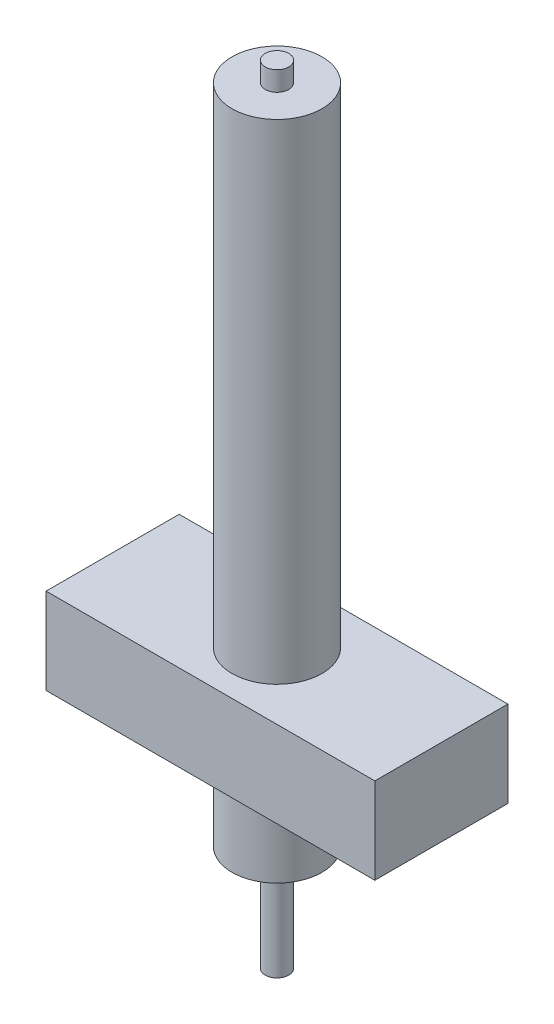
ISO-10303-21;
HEADER;
FILE_DESCRIPTION(('STEP AP214'),'2;1');
FILE_NAME('part.step','',(''),(''),'','','');
FILE_SCHEMA(('AUTOMOTIVE_DESIGN { 1 0 10303 214 1 1 1 1 }'));
ENDSEC;
DATA;
#1=APPLICATION_CONTEXT('core data for automotive mechanical design processes');
#2=APPLICATION_PROTOCOL_DEFINITION('international standard','automotive_design',2000,#1);
#3=PRODUCT_CONTEXT('',#1,'mechanical');
#4=PRODUCT('Part','Part','',(#3));
#5=PRODUCT_RELATED_PRODUCT_CATEGORY('part','',(#4));
#6=PRODUCT_DEFINITION_FORMATION('','',#4);
#7=PRODUCT_DEFINITION_CONTEXT('part definition',#1,'design');
#8=PRODUCT_DEFINITION('design','',#6,#7);
#9=PRODUCT_DEFINITION_SHAPE('','',#8);
#10=(LENGTH_UNIT() NAMED_UNIT(*) SI_UNIT(.MILLI.,.METRE.));
#11=(NAMED_UNIT(*) PLANE_ANGLE_UNIT() SI_UNIT($,.RADIAN.));
#12=(NAMED_UNIT(*) SI_UNIT($,.STERADIAN.) SOLID_ANGLE_UNIT());
#13=UNCERTAINTY_MEASURE_WITH_UNIT(LENGTH_MEASURE(1.E-05),#10,'distance_accuracy_value','');
#14=(GEOMETRIC_REPRESENTATION_CONTEXT(3) GLOBAL_UNCERTAINTY_ASSIGNED_CONTEXT((#13)) GLOBAL_UNIT_ASSIGNED_CONTEXT((#10,
#11,#12)) REPRESENTATION_CONTEXT('',''));
#15=CARTESIAN_POINT('',(0.,0.,0.));
#16=DIRECTION('',(0.,0.,1.));
#17=DIRECTION('',(1.,0.,0.));
#18=AXIS2_PLACEMENT_3D('',#15,#16,#17);
#19=CARTESIAN_POINT('',(0.,62.5,0.));
#20=DIRECTION('',(0.,-1.,0.));
#21=DIRECTION('',(0.,0.,-1.));
#22=AXIS2_PLACEMENT_3D('',#19,#20,#21);
#23=CYLINDRICAL_SURFACE('',#22,5.75);
#24=CARTESIAN_POINT('',(0.,62.5,0.));
#25=DIRECTION('',(0.,1.,0.));
#26=DIRECTION('',(0.,0.,1.));
#27=AXIS2_PLACEMENT_3D('',#24,#25,#26);
#28=CIRCLE('',#27,5.75);
#29=CARTESIAN_POINT('',(0.,62.5,5.75));
#30=VERTEX_POINT('',#29);
#31=EDGE_CURVE('E121',#30,#30,#28,.T.);
#32=ORIENTED_EDGE('',*,*,#31,.F.);
#33=EDGE_LOOP('',(#32));
#34=FACE_BOUND('',#33,.T.);
#35=CARTESIAN_POINT('',(0.,0.,0.));
#36=DIRECTION('',(0.,1.,0.));
#37=DIRECTION('',(0.,0.,1.));
#38=AXIS2_PLACEMENT_3D('',#35,#36,#37);
#39=CIRCLE('',#38,5.75);
#40=CARTESIAN_POINT('',(0.,0.,5.75));
#41=VERTEX_POINT('',#40);
#42=EDGE_CURVE('E42',#41,#41,#39,.T.);
#43=ORIENTED_EDGE('',*,*,#42,.T.);
#44=EDGE_LOOP('',(#43));
#45=FACE_BOUND('',#44,.T.);
#46=ADVANCED_FACE('F39',(#34,#45),#23,.T.);
#47=CARTESIAN_POINT('',(0.,62.5,0.));
#48=DIRECTION('',(0.,1.,0.));
#49=DIRECTION('',(0.,0.,1.));
#50=AXIS2_PLACEMENT_3D('',#47,#48,#49);
#51=PLANE('',#50);
#52=CARTESIAN_POINT('',(0.,62.5,0.));
#53=DIRECTION('',(0.,1.,0.));
#54=DIRECTION('',(0.,0.,1.));
#55=AXIS2_PLACEMENT_3D('',#52,#53,#54);
#56=CIRCLE('',#55,1.5);
#57=CARTESIAN_POINT('',(0.,62.5,1.5));
#58=VERTEX_POINT('',#57);
#59=EDGE_CURVE('E122',#58,#58,#56,.T.);
#60=ORIENTED_EDGE('',*,*,#59,.F.);
#61=EDGE_LOOP('',(#60));
#62=FACE_BOUND('',#61,.T.);
#63=ORIENTED_EDGE('',*,*,#31,.T.);
#64=EDGE_LOOP('',(#63));
#65=FACE_BOUND('',#64,.T.);
#66=ADVANCED_FACE('F127',(#62,#65),#51,.T.);
#67=CARTESIAN_POINT('',(0.,65.,0.));
#68=DIRECTION('',(0.,-1.,0.));
#69=DIRECTION('',(0.,0.,-1.));
#70=AXIS2_PLACEMENT_3D('',#67,#68,#69);
#71=CYLINDRICAL_SURFACE('',#70,1.5);
#72=CARTESIAN_POINT('',(0.,65.,0.));
#73=DIRECTION('',(0.,1.,0.));
#74=DIRECTION('',(0.,0.,1.));
#75=AXIS2_PLACEMENT_3D('',#72,#73,#74);
#76=CIRCLE('',#75,1.5);
#77=CARTESIAN_POINT('',(0.,65.,1.5));
#78=VERTEX_POINT('',#77);
#79=EDGE_CURVE('E118',#78,#78,#76,.T.);
#80=ORIENTED_EDGE('',*,*,#79,.F.);
#81=EDGE_LOOP('',(#80));
#82=FACE_BOUND('',#81,.T.);
#83=ORIENTED_EDGE('',*,*,#59,.T.);
#84=EDGE_LOOP('',(#83));
#85=FACE_BOUND('',#84,.T.);
#86=ADVANCED_FACE('F160',(#82,#85),#71,.T.);
#87=CARTESIAN_POINT('',(0.,65.,0.));
#88=DIRECTION('',(0.,1.,0.));
#89=DIRECTION('',(0.,0.,1.));
#90=AXIS2_PLACEMENT_3D('',#87,#88,#89);
#91=PLANE('',#90);
#92=ORIENTED_EDGE('',*,*,#79,.T.);
#93=EDGE_LOOP('',(#92));
#94=FACE_BOUND('',#93,.T.);
#95=ADVANCED_FACE('F157',(#94),#91,.T.);
#96=CARTESIAN_POINT('',(21.,-11.,-8.5));
#97=DIRECTION('',(-1.,0.,0.));
#98=DIRECTION('',(0.,0.,1.));
#99=AXIS2_PLACEMENT_3D('',#96,#97,#98);
#100=PLANE('',#99);
#101=DIRECTION('',(0.,0.,1.));
#102=VECTOR('',#101,1.);
#103=CARTESIAN_POINT('',(21.,0.,-8.5));
#104=LINE('',#103,#102);
#105=CARTESIAN_POINT('',(21.,0.,-8.5));
#106=VERTEX_POINT('',#105);
#107=CARTESIAN_POINT('',(21.,0.,8.5));
#108=VERTEX_POINT('',#107);
#109=EDGE_CURVE('E108',#106,#108,#104,.T.);
#110=ORIENTED_EDGE('',*,*,#109,.T.);
#111=DIRECTION('',(0.,1.,0.));
#112=VECTOR('',#111,1.);
#113=CARTESIAN_POINT('',(21.,-11.,8.5));
#114=LINE('',#113,#112);
#115=CARTESIAN_POINT('',(21.,-11.,8.5));
#116=VERTEX_POINT('',#115);
#117=EDGE_CURVE('E99',#116,#108,#114,.T.);
#118=ORIENTED_EDGE('',*,*,#117,.F.);
#119=DIRECTION('',(0.,0.,1.));
#120=VECTOR('',#119,1.);
#121=CARTESIAN_POINT('',(21.,-11.,-8.5));
#122=LINE('',#121,#120);
#123=CARTESIAN_POINT('',(21.,-11.,-8.5));
#124=VERTEX_POINT('',#123);
#125=EDGE_CURVE('E93',#124,#116,#122,.T.);
#126=ORIENTED_EDGE('',*,*,#125,.F.);
#127=DIRECTION('',(0.,1.,0.));
#128=VECTOR('',#127,1.);
#129=CARTESIAN_POINT('',(21.,-11.,-8.5));
#130=LINE('',#129,#128);
#131=EDGE_CURVE('E104',#124,#106,#130,.T.);
#132=ORIENTED_EDGE('',*,*,#131,.T.);
#133=EDGE_LOOP('',(#110,#118,#126,#132));
#134=FACE_BOUND('',#133,.T.);
#135=ADVANCED_FACE('F141',(#134),#100,.F.);
#136=CARTESIAN_POINT('',(-21.,-11.,8.5));
#137=DIRECTION('',(0.,0.,-1.));
#138=DIRECTION('',(-1.,0.,0.));
#139=AXIS2_PLACEMENT_3D('',#136,#137,#138);
#140=PLANE('',#139);
#141=DIRECTION('',(-1.,0.,0.));
#142=VECTOR('',#141,1.);
#143=CARTESIAN_POINT('',(-21.,0.,8.5));
#144=LINE('',#143,#142);
#145=CARTESIAN_POINT('',(-21.,0.,8.5));
#146=VERTEX_POINT('',#145);
#147=EDGE_CURVE('E98',#108,#146,#144,.T.);
#148=ORIENTED_EDGE('',*,*,#147,.T.);
#149=DIRECTION('',(0.,1.,0.));
#150=VECTOR('',#149,1.);
#151=CARTESIAN_POINT('',(-21.,-11.,8.5));
#152=LINE('',#151,#150);
#153=CARTESIAN_POINT('',(-21.,-11.,8.5));
#154=VERTEX_POINT('',#153);
#155=EDGE_CURVE('E96',#154,#146,#152,.T.);
#156=ORIENTED_EDGE('',*,*,#155,.F.);
#157=DIRECTION('',(-1.,0.,0.));
#158=VECTOR('',#157,1.);
#159=CARTESIAN_POINT('',(-21.,-11.,8.5));
#160=LINE('',#159,#158);
#161=EDGE_CURVE('E88',#116,#154,#160,.T.);
#162=ORIENTED_EDGE('',*,*,#161,.F.);
#163=ORIENTED_EDGE('',*,*,#117,.T.);
#164=EDGE_LOOP('',(#148,#156,#162,#163));
#165=FACE_BOUND('',#164,.T.);
#166=ADVANCED_FACE('F97',(#165),#140,.F.);
#167=CARTESIAN_POINT('',(-21.,-11.,-8.5));
#168=DIRECTION('',(1.,0.,0.));
#169=DIRECTION('',(0.,0.,-1.));
#170=AXIS2_PLACEMENT_3D('',#167,#168,#169);
#171=PLANE('',#170);
#172=DIRECTION('',(0.,0.,-1.));
#173=VECTOR('',#172,1.);
#174=CARTESIAN_POINT('',(-21.,0.,-8.5));
#175=LINE('',#174,#173);
#176=CARTESIAN_POINT('',(-21.,0.,-8.5));
#177=VERTEX_POINT('',#176);
#178=EDGE_CURVE('E74',#146,#177,#175,.T.);
#179=ORIENTED_EDGE('',*,*,#178,.T.);
#180=DIRECTION('',(0.,1.,0.));
#181=VECTOR('',#180,1.);
#182=CARTESIAN_POINT('',(-21.,-11.,-8.5));
#183=LINE('',#182,#181);
#184=CARTESIAN_POINT('',(-21.,-11.,-8.5));
#185=VERTEX_POINT('',#184);
#186=EDGE_CURVE('E100',#185,#177,#183,.T.);
#187=ORIENTED_EDGE('',*,*,#186,.F.);
#188=DIRECTION('',(0.,0.,-1.));
#189=VECTOR('',#188,1.);
#190=CARTESIAN_POINT('',(-21.,-11.,-8.5));
#191=LINE('',#190,#189);
#192=EDGE_CURVE('E91',#154,#185,#191,.T.);
#193=ORIENTED_EDGE('',*,*,#192,.F.);
#194=ORIENTED_EDGE('',*,*,#155,.T.);
#195=EDGE_LOOP('',(#179,#187,#193,#194));
#196=FACE_BOUND('',#195,.T.);
#197=ADVANCED_FACE('F102',(#196),#171,.F.);
#198=CARTESIAN_POINT('',(-21.,-11.,-8.5));
#199=DIRECTION('',(0.,0.,1.));
#200=DIRECTION('',(1.,0.,0.));
#201=AXIS2_PLACEMENT_3D('',#198,#199,#200);
#202=PLANE('',#201);
#203=DIRECTION('',(1.,0.,0.));
#204=VECTOR('',#203,1.);
#205=CARTESIAN_POINT('',(-21.,0.,-8.5));
#206=LINE('',#205,#204);
#207=EDGE_CURVE('E80',#177,#106,#206,.T.);
#208=ORIENTED_EDGE('',*,*,#207,.T.);
#209=ORIENTED_EDGE('',*,*,#131,.F.);
#210=DIRECTION('',(1.,0.,0.));
#211=VECTOR('',#210,1.);
#212=CARTESIAN_POINT('',(-21.,-11.,-8.5));
#213=LINE('',#212,#211);
#214=EDGE_CURVE('E57',#185,#124,#213,.T.);
#215=ORIENTED_EDGE('',*,*,#214,.F.);
#216=ORIENTED_EDGE('',*,*,#186,.T.);
#217=EDGE_LOOP('',(#208,#209,#215,#216));
#218=FACE_BOUND('',#217,.T.);
#219=ADVANCED_FACE('F142',(#218),#202,.F.);
#220=CARTESIAN_POINT('',(0.,-11.,0.));
#221=DIRECTION('',(0.,1.,0.));
#222=DIRECTION('',(0.,0.,1.));
#223=AXIS2_PLACEMENT_3D('',#220,#221,#222);
#224=PLANE('',#223);
#225=CARTESIAN_POINT('',(0.,-11.,0.));
#226=DIRECTION('',(0.,-1.,0.));
#227=DIRECTION('',(0.,0.,-1.));
#228=AXIS2_PLACEMENT_3D('',#225,#226,#227);
#229=CIRCLE('',#228,5.75);
#230=CARTESIAN_POINT('',(0.,-11.,-5.75));
#231=VERTEX_POINT('',#230);
#232=EDGE_CURVE('E48',#231,#231,#229,.T.);
#233=ORIENTED_EDGE('',*,*,#232,.F.);
#234=EDGE_LOOP('',(#233));
#235=FACE_BOUND('',#234,.T.);
#236=ORIENTED_EDGE('',*,*,#125,.T.);
#237=ORIENTED_EDGE('',*,*,#161,.T.);
#238=ORIENTED_EDGE('',*,*,#192,.T.);
#239=ORIENTED_EDGE('',*,*,#214,.T.);
#240=EDGE_LOOP('',(#236,#237,#238,#239));
#241=FACE_BOUND('',#240,.T.);
#242=ADVANCED_FACE('F89',(#235,#241),#224,.F.);
#243=CARTESIAN_POINT('',(0.,0.,0.));
#244=DIRECTION('',(0.,1.,0.));
#245=DIRECTION('',(0.,0.,1.));
#246=AXIS2_PLACEMENT_3D('',#243,#244,#245);
#247=PLANE('',#246);
#248=ORIENTED_EDGE('',*,*,#42,.F.);
#249=EDGE_LOOP('',(#248));
#250=FACE_BOUND('',#249,.T.);
#251=ORIENTED_EDGE('',*,*,#109,.F.);
#252=ORIENTED_EDGE('',*,*,#207,.F.);
#253=ORIENTED_EDGE('',*,*,#178,.F.);
#254=ORIENTED_EDGE('',*,*,#147,.F.);
#255=EDGE_LOOP('',(#251,#252,#253,#254));
#256=FACE_BOUND('',#255,.T.);
#257=ADVANCED_FACE('F134',(#250,#256),#247,.T.);
#258=CARTESIAN_POINT('',(0.,-22.,0.));
#259=DIRECTION('',(0.,1.,0.));
#260=DIRECTION('',(0.,0.,1.));
#261=AXIS2_PLACEMENT_3D('',#258,#259,#260);
#262=CYLINDRICAL_SURFACE('',#261,5.75);
#263=CARTESIAN_POINT('',(0.,-22.,0.));
#264=DIRECTION('',(0.,-1.,0.));
#265=DIRECTION('',(0.,0.,-1.));
#266=AXIS2_PLACEMENT_3D('',#263,#264,#265);
#267=CIRCLE('',#266,5.75);
#268=CARTESIAN_POINT('',(0.,-22.,-5.75));
#269=VERTEX_POINT('',#268);
#270=EDGE_CURVE('E111',#269,#269,#267,.T.);
#271=ORIENTED_EDGE('',*,*,#270,.F.);
#272=EDGE_LOOP('',(#271));
#273=FACE_BOUND('',#272,.T.);
#274=ORIENTED_EDGE('',*,*,#232,.T.);
#275=EDGE_LOOP('',(#274));
#276=FACE_BOUND('',#275,.T.);
#277=ADVANCED_FACE('F137',(#273,#276),#262,.T.);
#278=CARTESIAN_POINT('',(0.,-22.,0.));
#279=DIRECTION('',(0.,-1.,0.));
#280=DIRECTION('',(0.,0.,-1.));
#281=AXIS2_PLACEMENT_3D('',#278,#279,#280);
#282=PLANE('',#281);
#283=CARTESIAN_POINT('',(0.,-22.,0.));
#284=DIRECTION('',(0.,-1.,0.));
#285=DIRECTION('',(0.,0.,-1.));
#286=AXIS2_PLACEMENT_3D('',#283,#284,#285);
#287=CIRCLE('',#286,1.5);
#288=CARTESIAN_POINT('',(0.,-22.,-1.5));
#289=VERTEX_POINT('',#288);
#290=EDGE_CURVE('E11',#289,#289,#287,.T.);
#291=ORIENTED_EDGE('',*,*,#290,.F.);
#292=EDGE_LOOP('',(#291));
#293=FACE_BOUND('',#292,.T.);
#294=ORIENTED_EDGE('',*,*,#270,.T.);
#295=EDGE_LOOP('',(#294));
#296=FACE_BOUND('',#295,.T.);
#297=ADVANCED_FACE('F223',(#293,#296),#282,.T.);
#298=CARTESIAN_POINT('',(0.,-35.5,0.));
#299=DIRECTION('',(0.,1.,0.));
#300=DIRECTION('',(0.,0.,1.));
#301=AXIS2_PLACEMENT_3D('',#298,#299,#300);
#302=CYLINDRICAL_SURFACE('',#301,1.5);
#303=CARTESIAN_POINT('',(0.,-35.5,0.));
#304=DIRECTION('',(0.,-1.,0.));
#305=DIRECTION('',(0.,0.,-1.));
#306=AXIS2_PLACEMENT_3D('',#303,#304,#305);
#307=CIRCLE('',#306,1.5);
#308=CARTESIAN_POINT('',(0.,-35.5,-1.5));
#309=VERTEX_POINT('',#308);
#310=EDGE_CURVE('E258',#309,#309,#307,.T.);
#311=ORIENTED_EDGE('',*,*,#310,.F.);
#312=EDGE_LOOP('',(#311));
#313=FACE_BOUND('',#312,.T.);
#314=ORIENTED_EDGE('',*,*,#290,.T.);
#315=EDGE_LOOP('',(#314));
#316=FACE_BOUND('',#315,.T.);
#317=ADVANCED_FACE('F233',(#313,#316),#302,.T.);
#318=CARTESIAN_POINT('',(0.,-35.5,0.));
#319=DIRECTION('',(0.,-1.,0.));
#320=DIRECTION('',(0.,0.,-1.));
#321=AXIS2_PLACEMENT_3D('',#318,#319,#320);
#322=PLANE('',#321);
#323=ORIENTED_EDGE('',*,*,#310,.T.);
#324=EDGE_LOOP('',(#323));
#325=FACE_BOUND('',#324,.T.);
#326=ADVANCED_FACE('F243',(#325),#322,.T.);
#327=CLOSED_SHELL('',(#46,#66,#86,#95,#135,#166,#197,#219,#242,#257,#277,#297,#317,#326));
#328=MANIFOLD_SOLID_BREP('B2',#327);
#329=ADVANCED_BREP_SHAPE_REPRESENTATION('',(#18,#328),#14);
#330=SHAPE_DEFINITION_REPRESENTATION(#9,#329);
ENDSEC;
END-ISO-10303-21;
